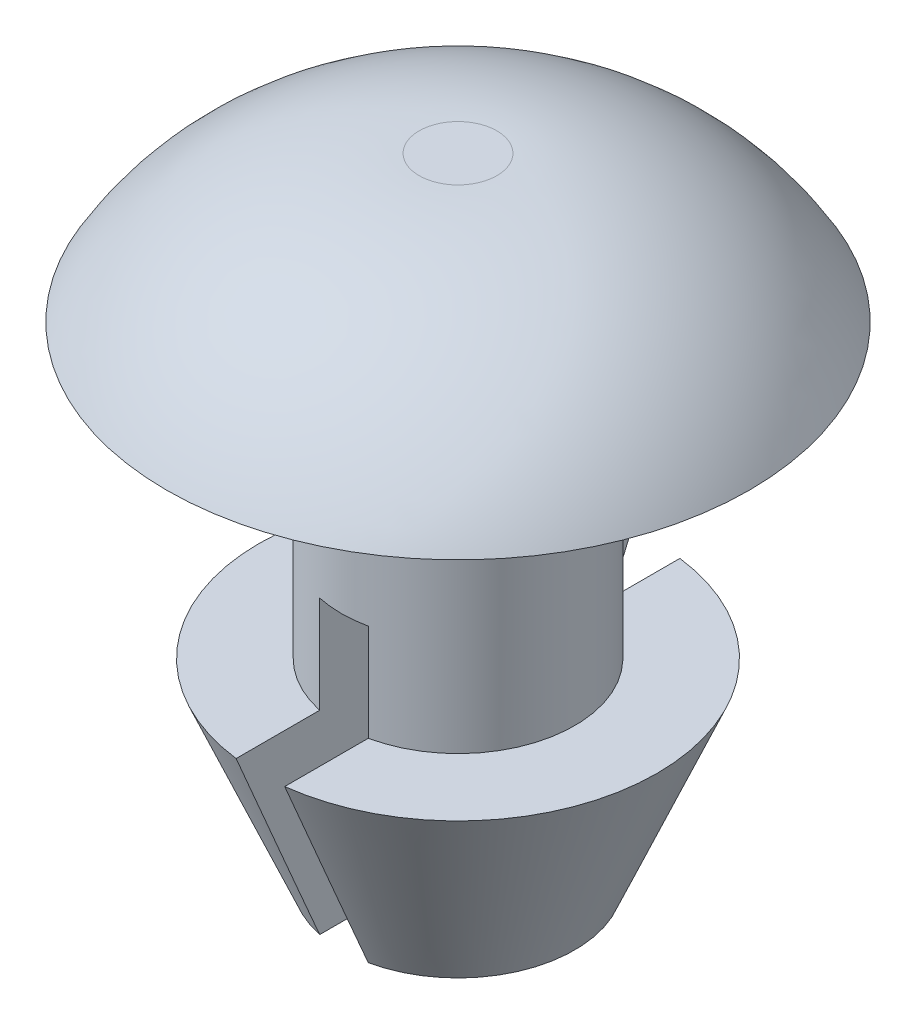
ISO-10303-21;
HEADER;
FILE_DESCRIPTION(('STEP AP214'),'2;1');
FILE_NAME('part.step','',(''),(''),'','','');
FILE_SCHEMA(('AUTOMOTIVE_DESIGN { 1 0 10303 214 1 1 1 1 }'));
ENDSEC;
DATA;
#1=APPLICATION_CONTEXT('core data for automotive mechanical design processes');
#2=APPLICATION_PROTOCOL_DEFINITION('international standard','automotive_design',2000,#1);
#3=PRODUCT_CONTEXT('',#1,'mechanical');
#4=PRODUCT('Part','Part','',(#3));
#5=PRODUCT_RELATED_PRODUCT_CATEGORY('part','',(#4));
#6=PRODUCT_DEFINITION_FORMATION('','',#4);
#7=PRODUCT_DEFINITION_CONTEXT('part definition',#1,'design');
#8=PRODUCT_DEFINITION('design','',#6,#7);
#9=PRODUCT_DEFINITION_SHAPE('','',#8);
#10=(LENGTH_UNIT() NAMED_UNIT(*) SI_UNIT(.MILLI.,.METRE.));
#11=(NAMED_UNIT(*) PLANE_ANGLE_UNIT() SI_UNIT($,.RADIAN.));
#12=(NAMED_UNIT(*) SI_UNIT($,.STERADIAN.) SOLID_ANGLE_UNIT());
#13=UNCERTAINTY_MEASURE_WITH_UNIT(LENGTH_MEASURE(1.E-05),#10,'distance_accuracy_value','');
#14=(GEOMETRIC_REPRESENTATION_CONTEXT(3) GLOBAL_UNCERTAINTY_ASSIGNED_CONTEXT((#13)) GLOBAL_UNIT_ASSIGNED_CONTEXT((#10,
#11,#12)) REPRESENTATION_CONTEXT('',''));
#15=CARTESIAN_POINT('',(0.,0.,0.));
#16=DIRECTION('',(0.,0.,1.));
#17=DIRECTION('',(1.,0.,0.));
#18=AXIS2_PLACEMENT_3D('',#15,#16,#17);
#19=CARTESIAN_POINT('',(0.,0.,0.));
#20=DIRECTION('',(0.,1.,0.));
#21=DIRECTION('',(0.,0.,-1.));
#22=AXIS2_PLACEMENT_3D('',#19,#20,#21);
#23=CONICAL_SURFACE('',#22,1.524,0.401425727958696);
#24=CARTESIAN_POINT('',(0.317500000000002,6.01485135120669,-4.06477178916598));
#25=CARTESIAN_POINT('',(0.317500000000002,5.56465766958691,-3.87307693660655));
#26=CARTESIAN_POINT('',(0.317500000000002,5.11448244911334,-3.68133842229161));
#27=CARTESIAN_POINT('',(0.317500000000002,4.21421762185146,-3.29763079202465));
#28=CARTESIAN_POINT('',(0.317500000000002,3.76412801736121,-3.10566167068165));
#29=CARTESIAN_POINT('',(0.317500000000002,2.8653958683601,-2.72191004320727));
#30=CARTESIAN_POINT('',(0.317500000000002,2.41675287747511,-2.53012858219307));
#31=CARTESIAN_POINT('',(0.317500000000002,1.51976135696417,-2.14590339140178));
#32=CARTESIAN_POINT('',(0.317500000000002,1.07141282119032,-1.9534596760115));
#33=CARTESIAN_POINT('',(0.317500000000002,0.448838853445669,-1.68491623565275));
#34=CARTESIAN_POINT('',(0.317500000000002,0.274320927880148,-1.60949496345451));
#35=CARTESIAN_POINT('',(0.317500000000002,-0.0745585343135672,-1.45826870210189));
#36=CARTESIAN_POINT('',(0.317500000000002,-0.248920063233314,-1.38246369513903));
#37=CARTESIAN_POINT('',(0.317500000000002,-0.597652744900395,-1.23012507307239));
#38=CARTESIAN_POINT('',(0.317500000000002,-0.772023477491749,-1.15359049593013));
#39=CARTESIAN_POINT('',(0.317500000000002,-1.12028069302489,-0.999487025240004));
#40=CARTESIAN_POINT('',(0.317500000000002,-1.29416724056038,-0.921918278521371));
#41=CARTESIAN_POINT('',(0.317500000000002,-1.55428320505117,-0.803928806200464));
#42=CARTESIAN_POINT('',(0.317500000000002,-1.6408801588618,-0.764321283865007));
#43=CARTESIAN_POINT('',(0.317500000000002,-1.8137047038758,-0.684223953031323));
#44=CARTESIAN_POINT('',(0.317500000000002,-1.89993214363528,-0.643733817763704));
#45=CARTESIAN_POINT('',(0.317500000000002,-2.0715427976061,-0.561416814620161));
#46=CARTESIAN_POINT('',(0.317500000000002,-2.15692736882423,-0.519592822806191));
#47=CARTESIAN_POINT('',(0.317500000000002,-2.28392154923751,-0.454795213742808));
#48=CARTESIAN_POINT('',(0.317500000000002,-2.32605914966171,-0.432859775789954));
#49=CARTESIAN_POINT('',(0.317500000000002,-2.40977155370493,-0.38794410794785));
#50=CARTESIAN_POINT('',(0.317500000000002,-2.45134646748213,-0.364964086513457));
#51=CARTESIAN_POINT('',(0.317500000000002,-2.51265309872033,-0.329407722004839));
#52=CARTESIAN_POINT('',(0.317500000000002,-2.53275643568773,-0.31747392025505));
#53=CARTESIAN_POINT('',(0.317500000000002,-2.57263825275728,-0.293050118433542));
#54=CARTESIAN_POINT('',(0.317500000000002,-2.59241657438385,-0.280559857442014));
#55=CARTESIAN_POINT('',(0.317500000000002,-2.63157038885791,-0.25477816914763));
#56=CARTESIAN_POINT('',(0.317500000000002,-2.65094374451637,-0.241483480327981));
#57=CARTESIAN_POINT('',(0.317500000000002,-2.68890819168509,-0.213829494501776));
#58=CARTESIAN_POINT('',(0.317500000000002,-2.70750002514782,-0.199471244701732));
#59=CARTESIAN_POINT('',(0.317500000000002,-2.74359793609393,-0.168965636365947));
#60=CARTESIAN_POINT('',(0.317500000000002,-2.7610854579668,-0.152796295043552));
#61=CARTESIAN_POINT('',(0.317500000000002,-2.79329785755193,-0.117933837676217));
#62=CARTESIAN_POINT('',(0.317500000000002,-2.80804950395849,-0.0992686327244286));
#63=CARTESIAN_POINT('',(0.317500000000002,-2.82409402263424,-0.0709418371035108));
#64=CARTESIAN_POINT('',(0.317500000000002,-2.8280698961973,-0.0628462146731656));
#65=CARTESIAN_POINT('',(0.317500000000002,-2.8347288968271,-0.0461379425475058));
#66=CARTESIAN_POINT('',(0.317500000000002,-2.83741411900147,-0.0375261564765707));
#67=CARTESIAN_POINT('',(0.317500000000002,-2.84116749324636,-0.0198304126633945));
#68=CARTESIAN_POINT('',(0.317500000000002,-2.84221532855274,-0.0107419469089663));
#69=CARTESIAN_POINT('',(0.317500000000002,-2.84243646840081,0.00746153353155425));
#70=CARTESIAN_POINT('',(0.317500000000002,-2.84160946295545,0.0165765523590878));
#71=CARTESIAN_POINT('',(0.317500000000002,-2.838492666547,0.0331106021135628));
#72=CARTESIAN_POINT('',(0.317500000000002,-2.83644297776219,0.0405776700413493));
#73=CARTESIAN_POINT('',(0.317500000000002,-2.83132657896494,0.0551467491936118));
#74=CARTESIAN_POINT('',(0.317500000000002,-2.82825972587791,0.0622487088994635));
#75=CARTESIAN_POINT('',(0.317500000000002,-2.81827378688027,0.0821750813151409));
#76=CARTESIAN_POINT('',(0.317500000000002,-2.81035028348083,0.094489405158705));
#77=CARTESIAN_POINT('',(0.317500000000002,-2.792858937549,0.117903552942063));
#78=CARTESIAN_POINT('',(0.317500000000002,-2.78328325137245,0.128997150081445));
#79=CARTESIAN_POINT('',(0.317500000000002,-2.76268875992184,0.150711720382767));
#80=CARTESIAN_POINT('',(0.317500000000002,-2.75162432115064,0.161288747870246));
#81=CARTESIAN_POINT('',(0.317500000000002,-2.7288010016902,0.181672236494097));
#82=CARTESIAN_POINT('',(0.317500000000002,-2.71704145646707,0.191477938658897));
#83=CARTESIAN_POINT('',(0.317500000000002,-2.68100314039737,0.220088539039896));
#84=CARTESIAN_POINT('',(0.317500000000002,-2.65603545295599,0.238018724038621));
#85=CARTESIAN_POINT('',(0.317500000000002,-2.60494822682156,0.27261538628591));
#86=CARTESIAN_POINT('',(0.317500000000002,-2.57882045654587,0.289269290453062));
#87=CARTESIAN_POINT('',(0.317500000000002,-2.52603793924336,0.321583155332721));
#88=CARTESIAN_POINT('',(0.317500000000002,-2.49938446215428,0.337245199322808));
#89=CARTESIAN_POINT('',(0.317500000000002,-2.41996125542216,0.382623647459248));
#90=CARTESIAN_POINT('',(0.317500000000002,-2.36666460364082,0.41141034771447));
#91=CARTESIAN_POINT('',(0.317500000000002,-2.2593391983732,0.467594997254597));
#92=CARTESIAN_POINT('',(0.317500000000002,-2.20531024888,0.494992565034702));
#93=CARTESIAN_POINT('',(0.317500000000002,-2.0967329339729,0.548938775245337));
#94=CARTESIAN_POINT('',(0.317500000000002,-2.04218392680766,0.575486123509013));
#95=CARTESIAN_POINT('',(0.317500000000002,-1.9328060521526,0.62797778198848));
#96=CARTESIAN_POINT('',(0.317500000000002,-1.8779772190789,0.653922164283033));
#97=CARTESIAN_POINT('',(0.317500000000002,-1.71396985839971,0.730768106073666));
#98=CARTESIAN_POINT('',(0.317500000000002,-1.6045041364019,0.781055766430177));
#99=CARTESIAN_POINT('',(0.317500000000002,-1.38523323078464,0.880682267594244));
#100=CARTESIAN_POINT('',(0.317500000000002,-1.27542832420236,0.930021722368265));
#101=CARTESIAN_POINT('',(0.317500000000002,-0.945720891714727,1.07716548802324));
#102=CARTESIAN_POINT('',(0.317500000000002,-0.725444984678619,1.1741321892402));
#103=CARTESIAN_POINT('',(0.317500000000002,-0.284450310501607,1.3670560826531));
#104=CARTESIAN_POINT('',(0.317500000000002,-0.06373153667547,1.4630132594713));
#105=CARTESIAN_POINT('',(0.317500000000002,0.378017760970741,1.65437713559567));
#106=CARTESIAN_POINT('',(0.317500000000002,0.59904835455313,1.74978367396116));
#107=CARTESIAN_POINT('',(0.317500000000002,1.04125841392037,1.9402467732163));
#108=CARTESIAN_POINT('',(0.317500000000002,1.26243787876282,2.0353033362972));
#109=CARTESIAN_POINT('',(0.317500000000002,1.92703595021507,2.32052985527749));
#110=CARTESIAN_POINT('',(0.317500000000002,2.37059956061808,2.51036189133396));
#111=CARTESIAN_POINT('',(0.317500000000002,3.25787920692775,2.88957772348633));
#112=CARTESIAN_POINT('',(0.317500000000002,3.70159522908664,3.07896155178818));
#113=CARTESIAN_POINT('',(0.317500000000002,4.30121597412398,3.33468317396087));
#114=CARTESIAN_POINT('',(0.317500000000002,4.45707284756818,3.40113315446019));
#115=CARTESIAN_POINT('',(0.317500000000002,4.76880044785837,3.53400724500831));
#116=CARTESIAN_POINT('',(0.317500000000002,4.92467117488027,3.6004313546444));
#117=CARTESIAN_POINT('',(0.317500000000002,5.23625663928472,3.73318640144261));
#118=CARTESIAN_POINT('',(0.317500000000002,5.39197136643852,3.79951736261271));
#119=CARTESIAN_POINT('',(0.317500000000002,5.70340669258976,3.93215885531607));
#120=CARTESIAN_POINT('',(0.317500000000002,5.85912729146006,3.99846938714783));
#121=CARTESIAN_POINT('',(0.317500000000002,6.01485135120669,4.06477178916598));
#122=B_SPLINE_CURVE_WITH_KNOTS('',3,(#24,#25,#26,#27,#28,#29,#30,#31,#32,#33,#34,#35,#36,#37,
#38,#39,#40,#41,#42,#43,#44,#45,#46,#47,#48,#49,#50,#51,#52,#53,#54,#55,#56,#57,#58,#59,#60,#61,
#62,#63,#64,#65,#66,#67,#68,#69,#70,#71,#72,#73,#74,#75,#76,#77,#78,#79,#80,#81,#82,#83,#84,#85,
#86,#87,#88,#89,#90,#91,#92,#93,#94,#95,#96,#97,#98,#99,#100,#101,#102,#103,#104,#105,#106,#107,
#108,#109,#110,#111,#112,#113,#114,#115,#116,#117,#118,#119,#120,#121),.UNSPECIFIED.,.F.,.F.,(4,
2,2,2,2,2,2,2,2,2,2,2,2,2,2,2,2,2,2,2,2,2,2,2,2,2,2,2,2,2,2,2,2,2,2,2,2,2,2,2,2,2,2,2,2,2,2,2,
4),(0.,1.46792098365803,2.9358769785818,4.39962078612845,5.86333299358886,6.43368692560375,
7.00406757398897,7.57534951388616,8.14655119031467,8.43222231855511,8.7180010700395,
9.00320052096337,9.14570882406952,9.28818881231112,9.35831876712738,9.42848195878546,
9.49895165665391,9.56935286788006,9.6407270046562,9.71136097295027,9.7383355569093,
9.7652662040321,9.79252842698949,9.81979515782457,9.84293880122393,9.86608570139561,
9.90975818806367,9.95364401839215,9.99951106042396,10.0454226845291,10.1375392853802,
10.2304702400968,10.3231990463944,10.5048765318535,10.6866036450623,10.8685953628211,
11.0505652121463,11.4119479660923,11.7730882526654,12.4951026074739,13.2171279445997,
13.9393545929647,14.6615767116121,16.1090096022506,17.5563351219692,18.0646290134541,
18.5729307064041,19.0806923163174,19.5884461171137),.UNSPECIFIED.);
#123=CARTESIAN_POINT('',(0.317500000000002,2.54,-2.58272372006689));
#124=VERTEX_POINT('',#123);
#125=CARTESIAN_POINT('',(0.317500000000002,0.,-1.4905602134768));
#126=VERTEX_POINT('',#125);
#127=EDGE_CURVE('E153',#124,#126,#122,.T.);
#128=ORIENTED_EDGE('',*,*,#127,.F.);
#129=CARTESIAN_POINT('',(0.,2.54,0.));
#130=DIRECTION('',(0.,-1.,0.));
#131=DIRECTION('',(0.,0.,-1.));
#132=AXIS2_PLACEMENT_3D('',#129,#130,#131);
#133=CIRCLE('',#132,2.6021660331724);
#134=CARTESIAN_POINT('',(0.317500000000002,2.54,2.58272372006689));
#135=VERTEX_POINT('',#134);
#136=EDGE_CURVE('E190',#124,#135,#133,.T.);
#137=ORIENTED_EDGE('',*,*,#136,.T.);
#138=CARTESIAN_POINT('',(0.317500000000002,0.,1.4905602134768));
#139=VERTEX_POINT('',#138);
#140=EDGE_CURVE('E136',#139,#135,#122,.T.);
#141=ORIENTED_EDGE('',*,*,#140,.F.);
#142=CARTESIAN_POINT('',(0.,0.,0.));
#143=DIRECTION('',(0.,1.,0.));
#144=DIRECTION('',(0.,0.,1.));
#145=AXIS2_PLACEMENT_3D('',#142,#143,#144);
#146=CIRCLE('',#145,1.524);
#147=EDGE_CURVE('E192',#139,#126,#146,.T.);
#148=ORIENTED_EDGE('',*,*,#147,.T.);
#149=EDGE_LOOP('',(#128,#137,#141,#148));
#150=FACE_BOUND('',#149,.T.);
#151=ADVANCED_FACE('F41',(#150),#23,.T.);
#152=CARTESIAN_POINT('',(0.,2.54,0.));
#153=DIRECTION('',(0.,-1.,0.));
#154=DIRECTION('',(0.,0.,-1.));
#155=AXIS2_PLACEMENT_3D('',#152,#153,#154);
#156=PLANE('',#155);
#157=ORIENTED_EDGE('',*,*,#136,.F.);
#158=DIRECTION('',(0.,0.,1.));
#159=VECTOR('',#158,1.);
#160=CARTESIAN_POINT('',(0.317500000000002,2.54,0.));
#161=LINE('',#160,#159);
#162=CARTESIAN_POINT('',(0.317500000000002,2.54,-1.4905602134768));
#163=VERTEX_POINT('',#162);
#164=EDGE_CURVE('E138',#124,#163,#161,.T.);
#165=ORIENTED_EDGE('',*,*,#164,.T.);
#166=CARTESIAN_POINT('',(0.,2.54,0.));
#167=DIRECTION('',(0.,-1.,0.));
#168=DIRECTION('',(0.,0.,-1.));
#169=AXIS2_PLACEMENT_3D('',#166,#167,#168);
#170=CIRCLE('',#169,1.524);
#171=CARTESIAN_POINT('',(0.317500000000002,2.54,1.4905602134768));
#172=VERTEX_POINT('',#171);
#173=EDGE_CURVE('E211',#163,#172,#170,.T.);
#174=ORIENTED_EDGE('',*,*,#173,.T.);
#175=EDGE_CURVE('E131',#172,#135,#161,.T.);
#176=ORIENTED_EDGE('',*,*,#175,.T.);
#177=EDGE_LOOP('',(#157,#165,#174,#176));
#178=FACE_BOUND('',#177,.T.);
#179=ADVANCED_FACE('F170',(#178),#156,.F.);
#180=CARTESIAN_POINT('',(0.,0.,0.));
#181=DIRECTION('',(0.,1.,0.));
#182=DIRECTION('',(0.,0.,1.));
#183=AXIS2_PLACEMENT_3D('',#180,#181,#182);
#184=PLANE('',#183);
#185=ORIENTED_EDGE('',*,*,#147,.F.);
#186=DIRECTION('',(0.,0.,-1.));
#187=VECTOR('',#186,1.);
#188=CARTESIAN_POINT('',(0.317500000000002,0.,0.));
#189=LINE('',#188,#187);
#190=EDGE_CURVE('E117',#139,#126,#189,.T.);
#191=ORIENTED_EDGE('',*,*,#190,.T.);
#192=EDGE_LOOP('',(#185,#191));
#193=FACE_BOUND('',#192,.T.);
#194=ADVANCED_FACE('F176',(#193),#184,.F.);
#195=CARTESIAN_POINT('',(0.,6.35,0.));
#196=DIRECTION('',(0.,-1.,0.));
#197=DIRECTION('',(0.,0.,-1.));
#198=AXIS2_PLACEMENT_3D('',#195,#196,#197);
#199=CYLINDRICAL_SURFACE('',#198,1.524);
#200=CARTESIAN_POINT('',(0.,6.35,0.));
#201=DIRECTION('',(0.,1.,0.));
#202=DIRECTION('',(0.,0.,1.));
#203=AXIS2_PLACEMENT_3D('',#200,#201,#202);
#204=CIRCLE('',#203,1.524);
#205=CARTESIAN_POINT('',(0.,6.35,1.524));
#206=VERTEX_POINT('',#205);
#207=EDGE_CURVE('E206',#206,#206,#204,.T.);
#208=ORIENTED_EDGE('',*,*,#207,.F.);
#209=EDGE_LOOP('',(#208));
#210=FACE_BOUND('',#209,.T.);
#211=ORIENTED_EDGE('',*,*,#173,.F.);
#212=DIRECTION('',(0.,-1.,0.));
#213=VECTOR('',#212,1.);
#214=CARTESIAN_POINT('',(0.317500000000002,6.35,-1.4905602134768));
#215=LINE('',#214,#213);
#216=CARTESIAN_POINT('',(0.317500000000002,3.81,-1.4905602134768));
#217=VERTEX_POINT('',#216);
#218=EDGE_CURVE('E65',#163,#217,#215,.F.);
#219=ORIENTED_EDGE('',*,*,#218,.T.);
#220=CARTESIAN_POINT('',(0.,3.81,0.));
#221=DIRECTION('',(0.,1.,0.));
#222=DIRECTION('',(0.,0.,1.));
#223=AXIS2_PLACEMENT_3D('',#220,#221,#222);
#224=CIRCLE('',#223,1.524);
#225=CARTESIAN_POINT('',(-0.317500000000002,3.81,-1.4905602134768));
#226=VERTEX_POINT('',#225);
#227=EDGE_CURVE('E12',#217,#226,#224,.T.);
#228=ORIENTED_EDGE('',*,*,#227,.T.);
#229=DIRECTION('',(0.,-1.,0.));
#230=VECTOR('',#229,1.);
#231=CARTESIAN_POINT('',(-0.317500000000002,6.35,-1.4905602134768));
#232=LINE('',#231,#230);
#233=CARTESIAN_POINT('',(-0.317500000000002,2.54,-1.4905602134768));
#234=VERTEX_POINT('',#233);
#235=EDGE_CURVE('E122',#226,#234,#232,.T.);
#236=ORIENTED_EDGE('',*,*,#235,.T.);
#237=CARTESIAN_POINT('',(-0.317500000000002,2.54,1.4905602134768));
#238=VERTEX_POINT('',#237);
#239=EDGE_CURVE('E129',#238,#234,#170,.T.);
#240=ORIENTED_EDGE('',*,*,#239,.F.);
#241=DIRECTION('',(0.,-1.,0.));
#242=VECTOR('',#241,1.);
#243=CARTESIAN_POINT('',(-0.317500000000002,6.35,1.4905602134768));
#244=LINE('',#243,#242);
#245=CARTESIAN_POINT('',(-0.317500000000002,3.81,1.4905602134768));
#246=VERTEX_POINT('',#245);
#247=EDGE_CURVE('E119',#238,#246,#244,.F.);
#248=ORIENTED_EDGE('',*,*,#247,.T.);
#249=CARTESIAN_POINT('',(0.317500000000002,3.81,1.4905602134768));
#250=VERTEX_POINT('',#249);
#251=EDGE_CURVE('E45',#246,#250,#224,.T.);
#252=ORIENTED_EDGE('',*,*,#251,.T.);
#253=DIRECTION('',(0.,-1.,0.));
#254=VECTOR('',#253,1.);
#255=CARTESIAN_POINT('',(0.317500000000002,6.35,1.4905602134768));
#256=LINE('',#255,#254);
#257=EDGE_CURVE('E152',#250,#172,#256,.T.);
#258=ORIENTED_EDGE('',*,*,#257,.T.);
#259=EDGE_LOOP('',(#211,#219,#228,#236,#240,#248,#252,#258));
#260=FACE_BOUND('',#259,.T.);
#261=ADVANCED_FACE('F43',(#210,#260),#199,.T.);
#262=CARTESIAN_POINT('',(-0.317500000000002,6.01485135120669,4.06477178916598));
#263=CARTESIAN_POINT('',(-0.317500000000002,5.56465766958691,3.87307693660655));
#264=CARTESIAN_POINT('',(-0.317500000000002,5.11448244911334,3.68133842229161));
#265=CARTESIAN_POINT('',(-0.317500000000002,4.21421762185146,3.29763079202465));
#266=CARTESIAN_POINT('',(-0.317500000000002,3.76412801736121,3.10566167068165));
#267=CARTESIAN_POINT('',(-0.317500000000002,2.8653958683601,2.72191004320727));
#268=CARTESIAN_POINT('',(-0.317500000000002,2.41675287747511,2.53012858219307));
#269=CARTESIAN_POINT('',(-0.317500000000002,1.51976135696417,2.14590339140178));
#270=CARTESIAN_POINT('',(-0.317500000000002,1.07141282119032,1.9534596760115));
#271=CARTESIAN_POINT('',(-0.317500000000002,0.448838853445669,1.68491623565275));
#272=CARTESIAN_POINT('',(-0.317500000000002,0.274320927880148,1.60949496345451));
#273=CARTESIAN_POINT('',(-0.317500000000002,-0.0745585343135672,1.45826870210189));
#274=CARTESIAN_POINT('',(-0.317500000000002,-0.248920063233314,1.38246369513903));
#275=CARTESIAN_POINT('',(-0.317500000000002,-0.597652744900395,1.23012507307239));
#276=CARTESIAN_POINT('',(-0.317500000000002,-0.772023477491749,1.15359049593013));
#277=CARTESIAN_POINT('',(-0.317500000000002,-1.12028069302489,0.999487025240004));
#278=CARTESIAN_POINT('',(-0.317500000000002,-1.29416724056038,0.921918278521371));
#279=CARTESIAN_POINT('',(-0.317500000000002,-1.55428320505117,0.803928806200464));
#280=CARTESIAN_POINT('',(-0.317500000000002,-1.6408801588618,0.764321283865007));
#281=CARTESIAN_POINT('',(-0.317500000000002,-1.8137047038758,0.684223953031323));
#282=CARTESIAN_POINT('',(-0.317500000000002,-1.89993214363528,0.643733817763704));
#283=CARTESIAN_POINT('',(-0.317500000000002,-2.0715427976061,0.561416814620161));
#284=CARTESIAN_POINT('',(-0.317500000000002,-2.15692736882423,0.519592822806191));
#285=CARTESIAN_POINT('',(-0.317500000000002,-2.28392154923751,0.454795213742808));
#286=CARTESIAN_POINT('',(-0.317500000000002,-2.32605914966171,0.432859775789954));
#287=CARTESIAN_POINT('',(-0.317500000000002,-2.40977155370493,0.38794410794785));
#288=CARTESIAN_POINT('',(-0.317500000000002,-2.45134646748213,0.364964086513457));
#289=CARTESIAN_POINT('',(-0.317500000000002,-2.51265309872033,0.329407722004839));
#290=CARTESIAN_POINT('',(-0.317500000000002,-2.53275643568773,0.31747392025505));
#291=CARTESIAN_POINT('',(-0.317500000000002,-2.57263825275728,0.293050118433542));
#292=CARTESIAN_POINT('',(-0.317500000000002,-2.59241657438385,0.280559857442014));
#293=CARTESIAN_POINT('',(-0.317500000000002,-2.63157038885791,0.25477816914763));
#294=CARTESIAN_POINT('',(-0.317500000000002,-2.65094374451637,0.241483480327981));
#295=CARTESIAN_POINT('',(-0.317500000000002,-2.68890819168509,0.213829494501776));
#296=CARTESIAN_POINT('',(-0.317500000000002,-2.70750002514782,0.199471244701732));
#297=CARTESIAN_POINT('',(-0.317500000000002,-2.74359793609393,0.168965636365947));
#298=CARTESIAN_POINT('',(-0.317500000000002,-2.7610854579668,0.152796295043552));
#299=CARTESIAN_POINT('',(-0.317500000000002,-2.79329785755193,0.117933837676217));
#300=CARTESIAN_POINT('',(-0.317500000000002,-2.80804950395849,0.0992686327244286));
#301=CARTESIAN_POINT('',(-0.317500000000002,-2.82409402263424,0.0709418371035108));
#302=CARTESIAN_POINT('',(-0.317500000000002,-2.8280698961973,0.0628462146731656));
#303=CARTESIAN_POINT('',(-0.317500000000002,-2.8347288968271,0.0461379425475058));
#304=CARTESIAN_POINT('',(-0.317500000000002,-2.83741411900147,0.0375261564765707));
#305=CARTESIAN_POINT('',(-0.317500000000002,-2.84116749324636,0.0198304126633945));
#306=CARTESIAN_POINT('',(-0.317500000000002,-2.84221532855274,0.0107419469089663));
#307=CARTESIAN_POINT('',(-0.317500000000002,-2.84243646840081,-0.00746153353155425));
#308=CARTESIAN_POINT('',(-0.317500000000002,-2.84160946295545,-0.0165765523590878));
#309=CARTESIAN_POINT('',(-0.317500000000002,-2.838492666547,-0.0331106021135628));
#310=CARTESIAN_POINT('',(-0.317500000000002,-2.83644297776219,-0.0405776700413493));
#311=CARTESIAN_POINT('',(-0.317500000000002,-2.83132657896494,-0.0551467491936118));
#312=CARTESIAN_POINT('',(-0.317500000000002,-2.82825972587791,-0.0622487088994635));
#313=CARTESIAN_POINT('',(-0.317500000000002,-2.81827378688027,-0.0821750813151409));
#314=CARTESIAN_POINT('',(-0.317500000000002,-2.81035028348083,-0.094489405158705));
#315=CARTESIAN_POINT('',(-0.317500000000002,-2.792858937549,-0.117903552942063));
#316=CARTESIAN_POINT('',(-0.317500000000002,-2.78328325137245,-0.128997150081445));
#317=CARTESIAN_POINT('',(-0.317500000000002,-2.76268875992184,-0.150711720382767));
#318=CARTESIAN_POINT('',(-0.317500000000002,-2.75162432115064,-0.161288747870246));
#319=CARTESIAN_POINT('',(-0.317500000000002,-2.7288010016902,-0.181672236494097));
#320=CARTESIAN_POINT('',(-0.317500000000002,-2.71704145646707,-0.191477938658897));
#321=CARTESIAN_POINT('',(-0.317500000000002,-2.68100314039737,-0.220088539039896));
#322=CARTESIAN_POINT('',(-0.317500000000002,-2.65603545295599,-0.238018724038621));
#323=CARTESIAN_POINT('',(-0.317500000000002,-2.60494822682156,-0.27261538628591));
#324=CARTESIAN_POINT('',(-0.317500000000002,-2.57882045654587,-0.289269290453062));
#325=CARTESIAN_POINT('',(-0.317500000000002,-2.52603793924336,-0.321583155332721));
#326=CARTESIAN_POINT('',(-0.317500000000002,-2.49938446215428,-0.337245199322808));
#327=CARTESIAN_POINT('',(-0.317500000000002,-2.41996125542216,-0.382623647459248));
#328=CARTESIAN_POINT('',(-0.317500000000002,-2.36666460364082,-0.41141034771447));
#329=CARTESIAN_POINT('',(-0.317500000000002,-2.2593391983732,-0.467594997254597));
#330=CARTESIAN_POINT('',(-0.317500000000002,-2.20531024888,-0.494992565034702));
#331=CARTESIAN_POINT('',(-0.317500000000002,-2.0967329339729,-0.548938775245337));
#332=CARTESIAN_POINT('',(-0.317500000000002,-2.04218392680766,-0.575486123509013));
#333=CARTESIAN_POINT('',(-0.317500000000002,-1.9328060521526,-0.62797778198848));
#334=CARTESIAN_POINT('',(-0.317500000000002,-1.8779772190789,-0.653922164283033));
#335=CARTESIAN_POINT('',(-0.317500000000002,-1.71396985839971,-0.730768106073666));
#336=CARTESIAN_POINT('',(-0.317500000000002,-1.6045041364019,-0.781055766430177));
#337=CARTESIAN_POINT('',(-0.317500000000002,-1.38523323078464,-0.880682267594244));
#338=CARTESIAN_POINT('',(-0.317500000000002,-1.27542832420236,-0.930021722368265));
#339=CARTESIAN_POINT('',(-0.317500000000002,-0.945720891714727,-1.07716548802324));
#340=CARTESIAN_POINT('',(-0.317500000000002,-0.725444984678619,-1.1741321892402));
#341=CARTESIAN_POINT('',(-0.317500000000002,-0.284450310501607,-1.3670560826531));
#342=CARTESIAN_POINT('',(-0.317500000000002,-0.06373153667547,-1.4630132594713));
#343=CARTESIAN_POINT('',(-0.317500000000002,0.378017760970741,-1.65437713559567));
#344=CARTESIAN_POINT('',(-0.317500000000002,0.59904835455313,-1.74978367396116));
#345=CARTESIAN_POINT('',(-0.317500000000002,1.04125841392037,-1.9402467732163));
#346=CARTESIAN_POINT('',(-0.317500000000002,1.26243787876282,-2.0353033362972));
#347=CARTESIAN_POINT('',(-0.317500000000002,1.92703595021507,-2.32052985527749));
#348=CARTESIAN_POINT('',(-0.317500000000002,2.37059956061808,-2.51036189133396));
#349=CARTESIAN_POINT('',(-0.317500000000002,3.25787920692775,-2.88957772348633));
#350=CARTESIAN_POINT('',(-0.317500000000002,3.70159522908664,-3.07896155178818));
#351=CARTESIAN_POINT('',(-0.317500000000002,4.30121597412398,-3.33468317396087));
#352=CARTESIAN_POINT('',(-0.317500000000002,4.45707284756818,-3.40113315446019));
#353=CARTESIAN_POINT('',(-0.317500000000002,4.76880044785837,-3.53400724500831));
#354=CARTESIAN_POINT('',(-0.317500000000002,4.92467117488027,-3.6004313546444));
#355=CARTESIAN_POINT('',(-0.317500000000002,5.23625663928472,-3.73318640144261));
#356=CARTESIAN_POINT('',(-0.317500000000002,5.39197136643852,-3.79951736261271));
#357=CARTESIAN_POINT('',(-0.317500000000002,5.70340669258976,-3.93215885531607));
#358=CARTESIAN_POINT('',(-0.317500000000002,5.85912729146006,-3.99846938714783));
#359=CARTESIAN_POINT('',(-0.317500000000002,6.01485135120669,-4.06477178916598));
#360=B_SPLINE_CURVE_WITH_KNOTS('',3,(#262,#263,#264,#265,#266,#267,#268,#269,#270,#271,#272,
#273,#274,#275,#276,#277,#278,#279,#280,#281,#282,#283,#284,#285,#286,#287,#288,#289,#290,#291,
#292,#293,#294,#295,#296,#297,#298,#299,#300,#301,#302,#303,#304,#305,#306,#307,#308,#309,#310,
#311,#312,#313,#314,#315,#316,#317,#318,#319,#320,#321,#322,#323,#324,#325,#326,#327,#328,#329,
#330,#331,#332,#333,#334,#335,#336,#337,#338,#339,#340,#341,#342,#343,#344,#345,#346,#347,#348,
#349,#350,#351,#352,#353,#354,#355,#356,#357,#358,#359),.UNSPECIFIED.,.F.,.F.,(4,2,2,2,2,2,2,2,
2,2,2,2,2,2,2,2,2,2,2,2,2,2,2,2,2,2,2,2,2,2,2,2,2,2,2,2,2,2,2,2,2,2,2,2,2,2,2,2,4),(0.,
1.46792098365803,2.9358769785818,4.39962078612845,5.86333299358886,6.43368692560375,
7.00406757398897,7.57534951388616,8.14655119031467,8.43222231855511,8.7180010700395,
9.00320052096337,9.14570882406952,9.28818881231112,9.35831876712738,9.42848195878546,
9.49895165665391,9.56935286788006,9.6407270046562,9.71136097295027,9.7383355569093,
9.7652662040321,9.79252842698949,9.81979515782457,9.84293880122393,9.86608570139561,
9.90975818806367,9.95364401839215,9.99951106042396,10.0454226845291,10.1375392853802,
10.2304702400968,10.3231990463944,10.5048765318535,10.6866036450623,10.8685953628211,
11.0505652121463,11.4119479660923,11.7730882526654,12.4951026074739,13.2171279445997,
13.9393545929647,14.6615767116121,16.1090096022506,17.5563351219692,18.0646290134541,
18.5729307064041,19.0806923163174,19.5884461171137),.UNSPECIFIED.);
#361=CARTESIAN_POINT('',(-0.317500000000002,2.54,2.58272372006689));
#362=VERTEX_POINT('',#361);
#363=CARTESIAN_POINT('',(-0.317500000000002,0.,1.4905602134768));
#364=VERTEX_POINT('',#363);
#365=EDGE_CURVE('E57',#362,#364,#360,.T.);
#366=ORIENTED_EDGE('',*,*,#365,.F.);
#367=CARTESIAN_POINT('',(-0.317500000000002,2.54,-2.58272372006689));
#368=VERTEX_POINT('',#367);
#369=EDGE_CURVE('E198',#362,#368,#133,.T.);
#370=ORIENTED_EDGE('',*,*,#369,.T.);
#371=CARTESIAN_POINT('',(-0.317500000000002,0.,-1.4905602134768));
#372=VERTEX_POINT('',#371);
#373=EDGE_CURVE('E141',#372,#368,#360,.T.);
#374=ORIENTED_EDGE('',*,*,#373,.F.);
#375=EDGE_CURVE('E197',#372,#364,#146,.T.);
#376=ORIENTED_EDGE('',*,*,#375,.T.);
#377=EDGE_LOOP('',(#366,#370,#374,#376));
#378=FACE_BOUND('',#377,.T.);
#379=ADVANCED_FACE('F155',(#378),#23,.T.);
#380=ORIENTED_EDGE('',*,*,#369,.F.);
#381=DIRECTION('',(0.,0.,-1.));
#382=VECTOR('',#381,1.);
#383=CARTESIAN_POINT('',(-0.317500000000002,2.54,0.));
#384=LINE('',#383,#382);
#385=EDGE_CURVE('E139',#362,#238,#384,.T.);
#386=ORIENTED_EDGE('',*,*,#385,.T.);
#387=ORIENTED_EDGE('',*,*,#239,.T.);
#388=EDGE_CURVE('E124',#234,#368,#384,.T.);
#389=ORIENTED_EDGE('',*,*,#388,.T.);
#390=EDGE_LOOP('',(#380,#386,#387,#389));
#391=FACE_BOUND('',#390,.T.);
#392=ADVANCED_FACE('F167',(#391),#156,.F.);
#393=ORIENTED_EDGE('',*,*,#375,.F.);
#394=DIRECTION('',(0.,0.,1.));
#395=VECTOR('',#394,1.);
#396=CARTESIAN_POINT('',(-0.317500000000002,0.,0.));
#397=LINE('',#396,#395);
#398=EDGE_CURVE('E214',#372,#364,#397,.T.);
#399=ORIENTED_EDGE('',*,*,#398,.T.);
#400=EDGE_LOOP('',(#393,#399));
#401=FACE_BOUND('',#400,.T.);
#402=ADVANCED_FACE('F166',(#401),#184,.F.);
#403=CARTESIAN_POINT('',(0.,3.81,0.));
#404=DIRECTION('',(0.,1.,0.));
#405=DIRECTION('',(0.,0.,1.));
#406=AXIS2_PLACEMENT_3D('',#403,#404,#405);
#407=PLANE('',#406);
#408=DIRECTION('',(0.,0.,1.));
#409=VECTOR('',#408,1.);
#410=CARTESIAN_POINT('',(0.317500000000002,3.81,8.18282110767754));
#411=LINE('',#410,#409);
#412=EDGE_CURVE('E112',#217,#250,#411,.T.);
#413=ORIENTED_EDGE('',*,*,#412,.T.);
#414=ORIENTED_EDGE('',*,*,#251,.F.);
#415=DIRECTION('',(0.,0.,-1.));
#416=VECTOR('',#415,1.);
#417=CARTESIAN_POINT('',(-0.317500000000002,3.81,8.18282110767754));
#418=LINE('',#417,#416);
#419=EDGE_CURVE('E111',#246,#226,#418,.T.);
#420=ORIENTED_EDGE('',*,*,#419,.T.);
#421=ORIENTED_EDGE('',*,*,#227,.F.);
#422=EDGE_LOOP('',(#413,#414,#420,#421));
#423=FACE_BOUND('',#422,.T.);
#424=ADVANCED_FACE('F110',(#423),#407,.F.);
#425=CARTESIAN_POINT('',(0.317500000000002,22.7279568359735,8.18282110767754));
#426=DIRECTION('',(1.,0.,0.));
#427=DIRECTION('',(0.,0.,-1.));
#428=AXIS2_PLACEMENT_3D('',#425,#426,#427);
#429=PLANE('',#428);
#430=ORIENTED_EDGE('',*,*,#164,.F.);
#431=ORIENTED_EDGE('',*,*,#127,.T.);
#432=ORIENTED_EDGE('',*,*,#190,.F.);
#433=ORIENTED_EDGE('',*,*,#140,.T.);
#434=ORIENTED_EDGE('',*,*,#175,.F.);
#435=ORIENTED_EDGE('',*,*,#257,.F.);
#436=ORIENTED_EDGE('',*,*,#412,.F.);
#437=ORIENTED_EDGE('',*,*,#218,.F.);
#438=EDGE_LOOP('',(#430,#431,#432,#433,#434,#435,#436,#437));
#439=FACE_BOUND('',#438,.T.);
#440=ADVANCED_FACE('F158',(#439),#429,.F.);
#441=CARTESIAN_POINT('',(-0.317500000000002,22.7279568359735,8.18282110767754));
#442=DIRECTION('',(-1.,0.,0.));
#443=DIRECTION('',(0.,0.,1.));
#444=AXIS2_PLACEMENT_3D('',#441,#442,#443);
#445=PLANE('',#444);
#446=ORIENTED_EDGE('',*,*,#385,.F.);
#447=ORIENTED_EDGE('',*,*,#365,.T.);
#448=ORIENTED_EDGE('',*,*,#398,.F.);
#449=ORIENTED_EDGE('',*,*,#373,.T.);
#450=ORIENTED_EDGE('',*,*,#388,.F.);
#451=ORIENTED_EDGE('',*,*,#235,.F.);
#452=ORIENTED_EDGE('',*,*,#419,.F.);
#453=ORIENTED_EDGE('',*,*,#247,.F.);
#454=EDGE_LOOP('',(#446,#447,#448,#449,#450,#451,#452,#453));
#455=FACE_BOUND('',#454,.T.);
#456=ADVANCED_FACE('F118',(#455),#445,.F.);
#457=CARTESIAN_POINT('',(0.,8.25923804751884,0.));
#458=DIRECTION('',(0.,1.,0.));
#459=DIRECTION('',(0.,0.,1.));
#460=AXIS2_PLACEMENT_3D('',#457,#458,#459);
#461=PLANE('',#460);
#462=CARTESIAN_POINT('',(0.,8.25923804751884,0.));
#463=DIRECTION('',(0.,-1.,0.));
#464=DIRECTION('',(0.,0.,-1.));
#465=AXIS2_PLACEMENT_3D('',#462,#463,#464);
#466=CIRCLE('',#465,0.508);
#467=CARTESIAN_POINT('',(0.,8.25923804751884,-0.508));
#468=VERTEX_POINT('',#467);
#469=EDGE_CURVE('E222',#468,#468,#466,.T.);
#470=ORIENTED_EDGE('',*,*,#469,.F.);
#471=EDGE_LOOP('',(#470));
#472=FACE_BOUND('',#471,.T.);
#473=ADVANCED_FACE('F250',(#472),#461,.T.);
#474=CARTESIAN_POINT('',(0.,4.44923804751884,0.));
#475=DIRECTION('',(0.,-1.,0.));
#476=DIRECTION('',(0.,0.,-1.));
#477=AXIS2_PLACEMENT_3D('',#474,#475,#476);
#478=DEGENERATE_TOROIDAL_SURFACE('',#477,0.508,3.81,.T.);
#479=ORIENTED_EDGE('',*,*,#469,.T.);
#480=EDGE_LOOP('',(#479));
#481=FACE_BOUND('',#480,.T.);
#482=CARTESIAN_POINT('',(0.,6.35,0.));
#483=DIRECTION('',(0.,-1.,0.));
#484=DIRECTION('',(0.,0.,-1.));
#485=AXIS2_PLACEMENT_3D('',#482,#483,#484);
#486=CIRCLE('',#485,3.81);
#487=CARTESIAN_POINT('',(0.,6.35,-3.81));
#488=VERTEX_POINT('',#487);
#489=EDGE_CURVE('E226',#488,#488,#486,.T.);
#490=ORIENTED_EDGE('',*,*,#489,.F.);
#491=EDGE_LOOP('',(#490));
#492=FACE_BOUND('',#491,.T.);
#493=ADVANCED_FACE('F248',(#481,#492),#478,.T.);
#494=CARTESIAN_POINT('',(0.,6.35,0.));
#495=DIRECTION('',(0.,-1.,0.));
#496=DIRECTION('',(0.,0.,-1.));
#497=AXIS2_PLACEMENT_3D('',#494,#495,#496);
#498=PLANE('',#497);
#499=ORIENTED_EDGE('',*,*,#207,.T.);
#500=EDGE_LOOP('',(#499));
#501=FACE_BOUND('',#500,.T.);
#502=ORIENTED_EDGE('',*,*,#489,.T.);
#503=EDGE_LOOP('',(#502));
#504=FACE_BOUND('',#503,.T.);
#505=ADVANCED_FACE('F246',(#501,#504),#498,.T.);
#506=CLOSED_SHELL('',(#151,#179,#194,#261,#379,#392,#402,#424,#440,#456,#473,#493,#505));
#507=MANIFOLD_SOLID_BREP('B2',#506);
#508=ADVANCED_BREP_SHAPE_REPRESENTATION('',(#18,#507),#14);
#509=SHAPE_DEFINITION_REPRESENTATION(#9,#508);
ENDSEC;
END-ISO-10303-21;
